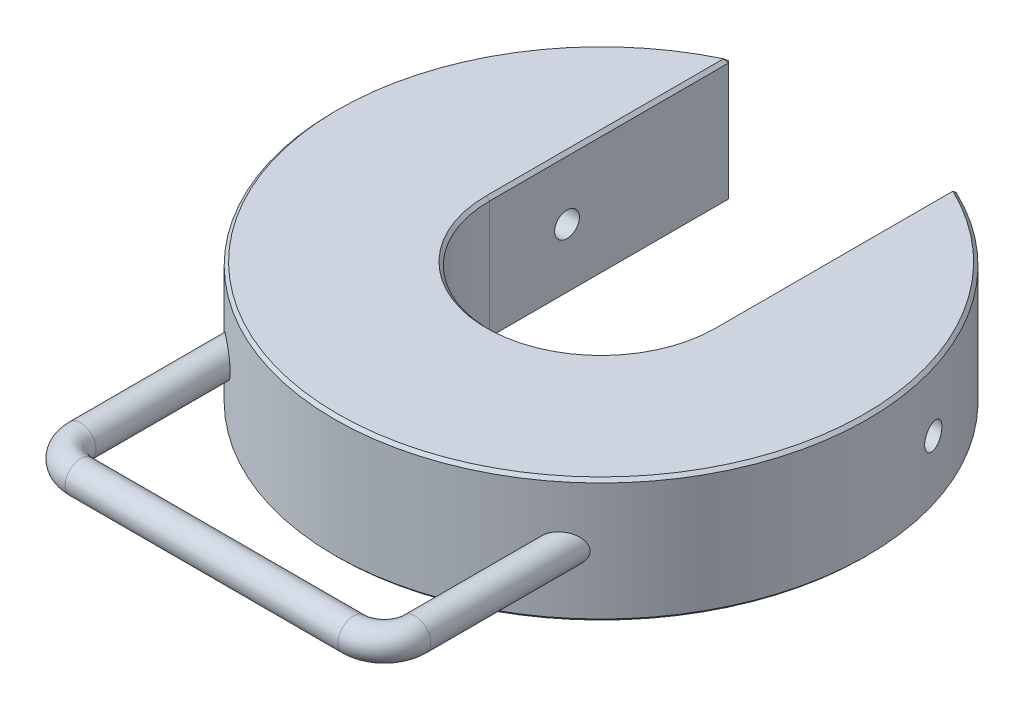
ISO-10303-21;
HEADER;
FILE_DESCRIPTION(('STEP AP214'),'2;1');
FILE_NAME('part.step','',(''),(''),'','','');
FILE_SCHEMA(('AUTOMOTIVE_DESIGN { 1 0 10303 214 1 1 1 1 }'));
ENDSEC;
DATA;
#1=APPLICATION_CONTEXT('core data for automotive mechanical design processes');
#2=APPLICATION_PROTOCOL_DEFINITION('international standard','automotive_design',2000,#1);
#3=PRODUCT_CONTEXT('',#1,'mechanical');
#4=PRODUCT('Part','Part','',(#3));
#5=PRODUCT_RELATED_PRODUCT_CATEGORY('part','',(#4));
#6=PRODUCT_DEFINITION_FORMATION('','',#4);
#7=PRODUCT_DEFINITION_CONTEXT('part definition',#1,'design');
#8=PRODUCT_DEFINITION('design','',#6,#7);
#9=PRODUCT_DEFINITION_SHAPE('','',#8);
#10=(LENGTH_UNIT() NAMED_UNIT(*) SI_UNIT(.MILLI.,.METRE.));
#11=(NAMED_UNIT(*) PLANE_ANGLE_UNIT() SI_UNIT($,.RADIAN.));
#12=(NAMED_UNIT(*) SI_UNIT($,.STERADIAN.) SOLID_ANGLE_UNIT());
#13=UNCERTAINTY_MEASURE_WITH_UNIT(LENGTH_MEASURE(1.E-05),#10,'distance_accuracy_value','');
#14=(GEOMETRIC_REPRESENTATION_CONTEXT(3) GLOBAL_UNCERTAINTY_ASSIGNED_CONTEXT((#13)) GLOBAL_UNIT_ASSIGNED_CONTEXT((#10,
#11,#12)) REPRESENTATION_CONTEXT('',''));
#15=CARTESIAN_POINT('',(0.,0.,0.));
#16=DIRECTION('',(0.,0.,1.));
#17=DIRECTION('',(1.,0.,0.));
#18=AXIS2_PLACEMENT_3D('',#15,#16,#17);
#19=CARTESIAN_POINT('',(0.,40.,0.));
#20=DIRECTION('',(0.,-1.,0.));
#21=DIRECTION('',(0.,0.,-1.));
#22=AXIS2_PLACEMENT_3D('',#19,#20,#21);
#23=CYLINDRICAL_SURFACE('',#22,86.);
#24=CARTESIAN_POINT('',(-59.,20.,62.5699608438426));
#25=CARTESIAN_POINT('',(-58.9999987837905,20.1139886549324,62.5699620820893));
#26=CARTESIAN_POINT('',(-58.9960933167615,20.2280110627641,62.5736453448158));
#27=CARTESIAN_POINT('',(-58.9805467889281,20.4551084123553,62.5882993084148));
#28=CARTESIAN_POINT('',(-58.9689006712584,20.5681826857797,62.5992747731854));
#29=CARTESIAN_POINT('',(-58.9380782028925,20.7926147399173,62.6282954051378));
#30=CARTESIAN_POINT('',(-58.9188866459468,20.903968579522,62.6463548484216));
#31=CARTESIAN_POINT('',(-58.8733355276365,21.1239330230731,62.6891644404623));
#32=CARTESIAN_POINT('',(-58.8469725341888,21.2325422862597,62.7139177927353));
#33=CARTESIAN_POINT('',(-58.7877792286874,21.4454344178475,62.7694085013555));
#34=CARTESIAN_POINT('',(-58.7550011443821,21.5497444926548,62.8000975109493));
#35=CARTESIAN_POINT('',(-58.6833499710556,21.754423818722,62.8670568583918));
#36=CARTESIAN_POINT('',(-58.6444746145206,21.8547915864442,62.9033292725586));
#37=CARTESIAN_POINT('',(-58.5195420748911,22.1492194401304,63.019648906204));
#38=CARTESIAN_POINT('',(-58.4251205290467,22.3368069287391,63.1072530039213));
#39=CARTESIAN_POINT('',(-58.1769139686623,22.7633605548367,63.3362857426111));
#40=CARTESIAN_POINT('',(-58.0144372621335,22.9931966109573,63.4852816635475));
#41=CARTESIAN_POINT('',(-57.751001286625,23.3089093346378,63.724690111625));
#42=CARTESIAN_POINT('',(-57.6597580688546,23.409429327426,63.8072746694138));
#43=CARTESIAN_POINT('',(-57.471519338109,23.6009117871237,63.9768752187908));
#44=CARTESIAN_POINT('',(-57.3745232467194,23.6918732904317,64.0638916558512));
#45=CARTESIAN_POINT('',(-57.0146199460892,24.0038531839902,64.385200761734));
#46=CARTESIAN_POINT('',(-56.7368953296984,24.1975082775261,64.6302577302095));
#47=CARTESIAN_POINT('',(-56.3034786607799,24.440890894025,65.0073500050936));
#48=CARTESIAN_POINT('',(-56.1560962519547,24.5142019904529,65.1347211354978));
#49=CARTESIAN_POINT('',(-55.8565376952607,24.6454251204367,65.3917889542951));
#50=CARTESIAN_POINT('',(-55.7043619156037,24.7033383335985,65.5214854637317));
#51=CARTESIAN_POINT('',(-55.2376079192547,24.8555681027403,65.9164160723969));
#52=CARTESIAN_POINT('',(-54.9169163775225,24.9260948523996,66.1839046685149));
#53=CARTESIAN_POINT('',(-54.2668513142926,25.0035926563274,66.7179571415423));
#54=CARTESIAN_POINT('',(-53.9374730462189,25.0105282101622,66.9845204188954));
#55=CARTESIAN_POINT('',(-53.4258744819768,24.9702828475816,67.3923623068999));
#56=CARTESIAN_POINT('',(-53.2437728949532,24.9459340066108,67.536315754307));
#57=CARTESIAN_POINT('',(-52.8807723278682,24.8766252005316,67.8209186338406));
#58=CARTESIAN_POINT('',(-52.6998735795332,24.8316613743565,67.9615674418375));
#59=CARTESIAN_POINT('',(-52.3413237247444,24.7205889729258,68.2380906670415));
#60=CARTESIAN_POINT('',(-52.1636684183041,24.6545101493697,68.3739715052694));
#61=CARTESIAN_POINT('',(-51.8134043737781,24.5006008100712,68.6397808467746));
#62=CARTESIAN_POINT('',(-51.6407954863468,24.4127709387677,68.7697095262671));
#63=CARTESIAN_POINT('',(-51.2373697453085,24.1763234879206,69.071103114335));
#64=CARTESIAN_POINT('',(-51.0099224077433,24.0173395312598,69.239148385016));
#65=CARTESIAN_POINT('',(-50.5774166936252,23.6558462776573,69.5557093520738));
#66=CARTESIAN_POINT('',(-50.3723261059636,23.4534008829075,69.7042532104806));
#67=CARTESIAN_POINT('',(-50.024335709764,23.042099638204,69.9543006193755));
#68=CARTESIAN_POINT('',(-49.8767404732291,22.8395442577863,70.0595270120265));
#69=CARTESIAN_POINT('',(-49.6769690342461,22.5154670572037,70.2011784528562));
#70=CARTESIAN_POINT('',(-49.6139587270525,22.4040127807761,70.2457139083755));
#71=CARTESIAN_POINT('',(-49.4959457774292,22.1748737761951,70.3289169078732));
#72=CARTESIAN_POINT('',(-49.4409396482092,22.0571917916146,70.3675870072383));
#73=CARTESIAN_POINT('',(-49.3393587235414,21.8154175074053,70.43884982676));
#74=CARTESIAN_POINT('',(-49.2928458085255,21.6912860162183,70.4713979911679));
#75=CARTESIAN_POINT('',(-49.2094907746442,21.438312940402,70.5296292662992));
#76=CARTESIAN_POINT('',(-49.172643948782,21.3094736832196,70.5553157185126));
#77=CARTESIAN_POINT('',(-49.1092386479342,21.048108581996,70.5994629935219));
#78=CARTESIAN_POINT('',(-49.0826774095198,20.9155837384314,70.6179257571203));
#79=CARTESIAN_POINT('',(-49.040320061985,20.6480086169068,70.6473472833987));
#80=CARTESIAN_POINT('',(-49.0245226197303,20.5129586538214,70.6583069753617));
#81=CARTESIAN_POINT('',(-49.0051738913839,20.2572966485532,70.6717273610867));
#82=CARTESIAN_POINT('',(-49.0004195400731,20.1368174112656,70.6750230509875));
#83=CARTESIAN_POINT('',(-48.9996335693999,19.8957737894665,70.6755680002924));
#84=CARTESIAN_POINT('',(-49.0036047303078,19.7752093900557,70.6728153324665));
#85=CARTESIAN_POINT('',(-49.0202109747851,19.5350465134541,70.6612978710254));
#86=CARTESIAN_POINT('',(-49.032840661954,19.4154474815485,70.6525368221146));
#87=CARTESIAN_POINT('',(-49.0665739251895,19.1779934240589,70.6291139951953));
#88=CARTESIAN_POINT('',(-49.0876806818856,19.0601390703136,70.6144500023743));
#89=CARTESIAN_POINT('',(-49.1371422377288,18.8313229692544,70.5800405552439));
#90=CARTESIAN_POINT('',(-49.1652037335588,18.7202667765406,70.5605005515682));
#91=CARTESIAN_POINT('',(-49.2285448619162,18.5012563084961,70.5163233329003));
#92=CARTESIAN_POINT('',(-49.2638269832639,18.3933031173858,70.4916843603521));
#93=CARTESIAN_POINT('',(-49.379869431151,18.0750960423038,70.4104924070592));
#94=CARTESIAN_POINT('',(-49.4708664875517,17.8703104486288,70.346636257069));
#95=CARTESIAN_POINT('',(-49.6832916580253,17.4658572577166,70.1967840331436));
#96=CARTESIAN_POINT('',(-49.8064010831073,17.2675456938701,70.1095532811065));
#97=CARTESIAN_POINT('',(-50.074224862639,16.8950092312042,69.918517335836));
#98=CARTESIAN_POINT('',(-50.2189489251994,16.7207952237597,69.8147046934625));
#99=CARTESIAN_POINT('',(-50.5476872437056,16.3741695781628,69.5771378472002));
#100=CARTESIAN_POINT('',(-50.7343513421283,16.2057621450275,69.4412252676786));
#101=CARTESIAN_POINT('',(-51.1235254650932,15.9028296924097,69.1552138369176));
#102=CARTESIAN_POINT('',(-51.3260449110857,15.7683250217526,69.0051065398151));
#103=CARTESIAN_POINT('',(-51.78146819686,15.5101126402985,68.6642187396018));
#104=CARTESIAN_POINT('',(-52.0366060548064,15.3933769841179,68.4711465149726));
#105=CARTESIAN_POINT('',(-52.5549434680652,15.2054281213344,68.074112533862));
#106=CARTESIAN_POINT('',(-52.8181475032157,15.1342407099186,67.8701446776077));
#107=CARTESIAN_POINT('',(-53.3983278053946,15.0259547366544,67.4149783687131));
#108=CARTESIAN_POINT('',(-53.7158561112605,14.998115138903,67.1622764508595));
#109=CARTESIAN_POINT('',(-54.3473936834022,15.0020848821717,66.6522744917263));
#110=CARTESIAN_POINT('',(-54.6613985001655,15.0339626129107,66.3949695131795));
#111=CARTESIAN_POINT('',(-55.1447658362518,15.1295544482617,65.9932326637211));
#112=CARTESIAN_POINT('',(-55.3178048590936,15.173468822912,65.8482386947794));
#113=CARTESIAN_POINT('',(-55.6594286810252,15.2800092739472,65.5597277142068));
#114=CARTESIAN_POINT('',(-55.8280125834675,15.3426390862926,65.4162110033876));
#115=CARTESIAN_POINT('',(-56.1592957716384,15.486680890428,65.1320282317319));
#116=CARTESIAN_POINT('',(-56.321998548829,15.5680815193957,64.9913605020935));
#117=CARTESIAN_POINT('',(-56.6401228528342,15.7499053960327,64.714302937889));
#118=CARTESIAN_POINT('',(-56.7955471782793,15.8503212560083,64.577911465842));
#119=CARTESIAN_POINT('',(-57.1641872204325,16.1192128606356,64.2521574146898));
#120=CARTESIAN_POINT('',(-57.3726926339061,16.2981819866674,64.065934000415));
#121=CARTESIAN_POINT('',(-57.7646146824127,16.6976160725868,63.7127827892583));
#122=CARTESIAN_POINT('',(-57.9480735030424,16.9180097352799,63.5458226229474));
#123=CARTESIAN_POINT('',(-58.243009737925,17.3452077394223,63.2754482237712));
#124=CARTESIAN_POINT('',(-58.3613502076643,17.5435669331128,63.1662374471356));
#125=CARTESIAN_POINT('',(-58.5726257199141,17.9637641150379,62.9703760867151));
#126=CARTESIAN_POINT('',(-58.6655805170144,18.185583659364,62.8837079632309));
#127=CARTESIAN_POINT('',(-58.8080391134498,18.6125364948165,62.7504789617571));
#128=CARTESIAN_POINT('',(-58.8620735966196,18.8148214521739,62.6997574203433));
#129=CARTESIAN_POINT('',(-58.9239794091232,19.1250278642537,62.6415629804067));
#130=CARTESIAN_POINT('',(-58.9414177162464,19.2294781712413,62.6251518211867));
#131=CARTESIAN_POINT('',(-58.9696771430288,19.4400336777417,62.5985428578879));
#132=CARTESIAN_POINT('',(-58.9805019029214,19.546137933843,62.5883416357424));
#133=CARTESIAN_POINT('',(-58.9919407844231,19.7103775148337,62.5775594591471));
#134=CARTESIAN_POINT('',(-58.9949607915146,19.7682159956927,62.5747122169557));
#135=CARTESIAN_POINT('',(-58.9989908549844,19.8840333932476,62.5709124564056));
#136=CARTESIAN_POINT('',(-59.0000006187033,19.9420123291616,62.5699602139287));
#137=CARTESIAN_POINT('',(-59.,20.,62.5699608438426));
#138=B_SPLINE_CURVE_WITH_KNOTS('',3,(#24,#25,#26,#27,#28,#29,#30,#31,#32,#33,#34,#35,#36,#37,
#38,#39,#40,#41,#42,#43,#44,#45,#46,#47,#48,#49,#50,#51,#52,#53,#54,#55,#56,#57,#58,#59,#60,#61,
#62,#63,#64,#65,#66,#67,#68,#69,#70,#71,#72,#73,#74,#75,#76,#77,#78,#79,#80,#81,#82,#83,#84,#85,
#86,#87,#88,#89,#90,#91,#92,#93,#94,#95,#96,#97,#98,#99,#100,#101,#102,#103,#104,#105,#106,#107,
#108,#109,#110,#111,#112,#113,#114,#115,#116,#117,#118,#119,#120,#121,#122,#123,#124,#125,#126,
#127,#128,#129,#130,#131,#132,#133,#134,#135,#136,#137),.UNSPECIFIED.,.T.,.F.,(4,2,2,2,2,2,2,2,
2,2,2,2,2,2,2,2,2,2,2,2,2,2,2,2,2,2,2,2,2,2,2,2,2,2,2,2,2,2,2,2,2,2,2,2,2,2,2,2,2,2,2,2,2,2,2,2,
4),(0.,0.341899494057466,0.684022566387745,1.02683867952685,1.36981914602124,1.71011545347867,
2.0505386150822,2.73073866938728,3.68071252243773,4.15706138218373,4.63345821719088,
5.87969275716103,6.5036533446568,7.12756611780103,8.39294186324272,9.65902397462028,
10.3584327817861,11.0579726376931,11.7565311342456,12.4550689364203,13.4243529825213,
14.3922215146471,15.20398227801,15.6102271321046,16.0162944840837,16.4252116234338,
16.8339292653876,17.242537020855,17.6510941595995,18.0124925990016,18.3740062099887,
18.7352947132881,19.0967189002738,19.4449251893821,19.7932517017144,20.4893390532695,
21.2340354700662,21.9790673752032,22.8332624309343,23.6879689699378,24.70596528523,
25.7245376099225,26.9401599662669,28.1571753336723,28.8464482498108,29.5358588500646,
30.2248532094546,30.9135804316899,31.9057688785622,32.8962650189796,33.6599439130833,
34.4230268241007,35.0662992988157,35.3874494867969,35.7084227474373,35.8823266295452,
36.0562558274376),.UNSPECIFIED.);
#139=CARTESIAN_POINT('',(-59.,20.,62.5699608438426));
#140=VERTEX_POINT('',#139);
#141=EDGE_CURVE('E12',#140,#140,#138,.T.);
#142=ORIENTED_EDGE('',*,*,#141,.T.);
#143=EDGE_LOOP('',(#142));
#144=FACE_BOUND('',#143,.T.);
#145=ADVANCED_FACE('F49',(#144),#23,.F.);
#146=CARTESIAN_POINT('',(-54.,20.,113.932802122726));
#147=DIRECTION('',(0.,0.,-1.));
#148=DIRECTION('',(-1.,0.,0.));
#149=AXIS2_PLACEMENT_3D('',#146,#147,#148);
#150=CYLINDRICAL_SURFACE('',#149,5.);
#151=ORIENTED_EDGE('',*,*,#141,.F.);
#152=EDGE_LOOP('',(#151));
#153=FACE_BOUND('',#152,.T.);
#154=CARTESIAN_POINT('',(-54.,20.,113.932802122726));
#155=DIRECTION('',(0.,0.,1.));
#156=DIRECTION('',(1.,0.,0.));
#157=AXIS2_PLACEMENT_3D('',#154,#155,#156);
#158=CIRCLE('',#157,5.);
#159=CARTESIAN_POINT('',(-59.,20.,113.932802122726));
#160=VERTEX_POINT('',#159);
#161=EDGE_CURVE('E94',#160,#160,#158,.T.);
#162=ORIENTED_EDGE('',*,*,#161,.F.);
#163=EDGE_LOOP('',(#162));
#164=FACE_BOUND('',#163,.T.);
#165=ADVANCED_FACE('F83',(#153,#164),#150,.T.);
#166=CARTESIAN_POINT('',(59.,20.,62.5699608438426));
#167=CARTESIAN_POINT('',(58.9999987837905,19.8860113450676,62.5699620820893));
#168=CARTESIAN_POINT('',(58.9960933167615,19.7719889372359,62.5736453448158));
#169=CARTESIAN_POINT('',(58.9805467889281,19.5448915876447,62.5882993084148));
#170=CARTESIAN_POINT('',(58.9689006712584,19.4318173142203,62.5992747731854));
#171=CARTESIAN_POINT('',(58.9380782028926,19.2073852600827,62.6282954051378));
#172=CARTESIAN_POINT('',(58.9188866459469,19.096031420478,62.6463548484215));
#173=CARTESIAN_POINT('',(58.8733355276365,18.8760669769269,62.6891644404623));
#174=CARTESIAN_POINT('',(58.8469725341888,18.7674577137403,62.7139177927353));
#175=CARTESIAN_POINT('',(58.7877792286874,18.5545655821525,62.7694085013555));
#176=CARTESIAN_POINT('',(58.7550011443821,18.4502555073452,62.8000975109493));
#177=CARTESIAN_POINT('',(58.6833499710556,18.245576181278,62.8670568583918));
#178=CARTESIAN_POINT('',(58.6444746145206,18.1452084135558,62.9033292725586));
#179=CARTESIAN_POINT('',(58.5195420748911,17.8507805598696,63.019648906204));
#180=CARTESIAN_POINT('',(58.4251205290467,17.6631930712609,63.1072530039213));
#181=CARTESIAN_POINT('',(58.1769139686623,17.2366394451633,63.3362857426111));
#182=CARTESIAN_POINT('',(58.0144372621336,17.0068033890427,63.4852816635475));
#183=CARTESIAN_POINT('',(57.751001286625,16.6910906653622,63.724690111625));
#184=CARTESIAN_POINT('',(57.6597580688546,16.590570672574,63.8072746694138));
#185=CARTESIAN_POINT('',(57.471519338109,16.3990882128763,63.9768752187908));
#186=CARTESIAN_POINT('',(57.3745232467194,16.3081267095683,64.0638916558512));
#187=CARTESIAN_POINT('',(57.0146199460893,15.9961468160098,64.385200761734));
#188=CARTESIAN_POINT('',(56.7368953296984,15.8024917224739,64.6302577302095));
#189=CARTESIAN_POINT('',(56.3034786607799,15.559109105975,65.0073500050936));
#190=CARTESIAN_POINT('',(56.1560962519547,15.4857980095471,65.1347211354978));
#191=CARTESIAN_POINT('',(55.8565376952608,15.3545748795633,65.3917889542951));
#192=CARTESIAN_POINT('',(55.7043619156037,15.2966616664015,65.5214854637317));
#193=CARTESIAN_POINT('',(55.2376079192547,15.1444318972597,65.9164160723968));
#194=CARTESIAN_POINT('',(54.9169163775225,15.0739051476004,66.1839046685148));
#195=CARTESIAN_POINT('',(54.2668513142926,14.9964073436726,66.7179571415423));
#196=CARTESIAN_POINT('',(53.9374730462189,14.9894717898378,66.9845204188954));
#197=CARTESIAN_POINT('',(53.4258744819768,15.0297171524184,67.3923623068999));
#198=CARTESIAN_POINT('',(53.2437728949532,15.0540659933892,67.536315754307));
#199=CARTESIAN_POINT('',(52.8807723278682,15.1233747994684,67.8209186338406));
#200=CARTESIAN_POINT('',(52.6998735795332,15.1683386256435,67.9615674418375));
#201=CARTESIAN_POINT('',(52.3413237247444,15.2794110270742,68.2380906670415));
#202=CARTESIAN_POINT('',(52.1636684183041,15.3454898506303,68.3739715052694));
#203=CARTESIAN_POINT('',(51.8134043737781,15.4993991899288,68.6397808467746));
#204=CARTESIAN_POINT('',(51.6407954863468,15.5872290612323,68.7697095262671));
#205=CARTESIAN_POINT('',(51.2373697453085,15.8236765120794,69.071103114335));
#206=CARTESIAN_POINT('',(51.0099224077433,15.9826604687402,69.239148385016));
#207=CARTESIAN_POINT('',(50.5774166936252,16.3441537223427,69.5557093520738));
#208=CARTESIAN_POINT('',(50.3723261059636,16.5465991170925,69.7042532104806));
#209=CARTESIAN_POINT('',(50.024335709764,16.957900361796,69.9543006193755));
#210=CARTESIAN_POINT('',(49.8767404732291,17.1604557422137,70.0595270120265));
#211=CARTESIAN_POINT('',(49.6769690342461,17.4845329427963,70.2011784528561));
#212=CARTESIAN_POINT('',(49.6139587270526,17.5959872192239,70.2457139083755));
#213=CARTESIAN_POINT('',(49.4959457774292,17.8251262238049,70.3289169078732));
#214=CARTESIAN_POINT('',(49.4409396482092,17.9428082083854,70.3675870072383));
#215=CARTESIAN_POINT('',(49.3393587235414,18.1845824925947,70.43884982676));
#216=CARTESIAN_POINT('',(49.2928458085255,18.3087139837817,70.4713979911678));
#217=CARTESIAN_POINT('',(49.2094907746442,18.561687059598,70.5296292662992));
#218=CARTESIAN_POINT('',(49.172643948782,18.6905263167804,70.5553157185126));
#219=CARTESIAN_POINT('',(49.1092386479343,18.951891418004,70.5994629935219));
#220=CARTESIAN_POINT('',(49.0826774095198,19.0844162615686,70.6179257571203));
#221=CARTESIAN_POINT('',(49.040320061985,19.3519913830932,70.6473472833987));
#222=CARTESIAN_POINT('',(49.0245226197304,19.4870413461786,70.6583069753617));
#223=CARTESIAN_POINT('',(49.005173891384,19.7427033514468,70.6717273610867));
#224=CARTESIAN_POINT('',(49.0004195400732,19.8631825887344,70.6750230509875));
#225=CARTESIAN_POINT('',(48.9996335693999,20.1042262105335,70.6755680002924));
#226=CARTESIAN_POINT('',(49.0036047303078,20.2247906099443,70.6728153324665));
#227=CARTESIAN_POINT('',(49.0202109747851,20.4649534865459,70.6612978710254));
#228=CARTESIAN_POINT('',(49.032840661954,20.5845525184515,70.6525368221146));
#229=CARTESIAN_POINT('',(49.0665739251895,20.8220065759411,70.6291139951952));
#230=CARTESIAN_POINT('',(49.0876806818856,20.9398609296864,70.6144500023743));
#231=CARTESIAN_POINT('',(49.1371422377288,21.1686770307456,70.5800405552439));
#232=CARTESIAN_POINT('',(49.1652037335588,21.2797332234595,70.5605005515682));
#233=CARTESIAN_POINT('',(49.2285448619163,21.4987436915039,70.5163233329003));
#234=CARTESIAN_POINT('',(49.2638269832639,21.6066968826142,70.4916843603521));
#235=CARTESIAN_POINT('',(49.379869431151,21.9249039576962,70.4104924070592));
#236=CARTESIAN_POINT('',(49.4708664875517,22.1296895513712,70.346636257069));
#237=CARTESIAN_POINT('',(49.6832916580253,22.5341427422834,70.1967840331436));
#238=CARTESIAN_POINT('',(49.8064010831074,22.7324543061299,70.1095532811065));
#239=CARTESIAN_POINT('',(50.074224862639,23.1049907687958,69.9185173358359));
#240=CARTESIAN_POINT('',(50.2189489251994,23.2792047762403,69.8147046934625));
#241=CARTESIAN_POINT('',(50.5476872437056,23.6258304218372,69.5771378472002));
#242=CARTESIAN_POINT('',(50.7343513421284,23.7942378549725,69.4412252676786));
#243=CARTESIAN_POINT('',(51.1235254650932,24.0971703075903,69.1552138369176));
#244=CARTESIAN_POINT('',(51.3260449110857,24.2316749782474,69.0051065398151));
#245=CARTESIAN_POINT('',(51.7814681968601,24.4898873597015,68.6642187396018));
#246=CARTESIAN_POINT('',(52.0366060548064,24.6066230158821,68.4711465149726));
#247=CARTESIAN_POINT('',(52.5549434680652,24.7945718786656,68.074112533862));
#248=CARTESIAN_POINT('',(52.8181475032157,24.8657592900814,67.8701446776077));
#249=CARTESIAN_POINT('',(53.3983278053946,24.9740452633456,67.4149783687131));
#250=CARTESIAN_POINT('',(53.7158561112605,25.001884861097,67.1622764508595));
#251=CARTESIAN_POINT('',(54.3473936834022,24.9979151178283,66.6522744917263));
#252=CARTESIAN_POINT('',(54.6613985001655,24.9660373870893,66.3949695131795));
#253=CARTESIAN_POINT('',(55.1447658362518,24.8704455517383,65.9932326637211));
#254=CARTESIAN_POINT('',(55.3178048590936,24.826531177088,65.8482386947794));
#255=CARTESIAN_POINT('',(55.6594286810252,24.7199907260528,65.5597277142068));
#256=CARTESIAN_POINT('',(55.8280125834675,24.6573609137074,65.4162110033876));
#257=CARTESIAN_POINT('',(56.1592957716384,24.513319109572,65.1320282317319));
#258=CARTESIAN_POINT('',(56.3219985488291,24.4319184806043,64.9913605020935));
#259=CARTESIAN_POINT('',(56.6401228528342,24.2500946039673,64.714302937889));
#260=CARTESIAN_POINT('',(56.7955471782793,24.1496787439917,64.577911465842));
#261=CARTESIAN_POINT('',(57.1641872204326,23.8807871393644,64.2521574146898));
#262=CARTESIAN_POINT('',(57.3726926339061,23.7018180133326,64.065934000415));
#263=CARTESIAN_POINT('',(57.7646146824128,23.3023839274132,63.7127827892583));
#264=CARTESIAN_POINT('',(57.9480735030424,23.0819902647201,63.5458226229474));
#265=CARTESIAN_POINT('',(58.243009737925,22.6547922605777,63.2754482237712));
#266=CARTESIAN_POINT('',(58.3613502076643,22.4564330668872,63.1662374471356));
#267=CARTESIAN_POINT('',(58.5726257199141,22.0362358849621,62.9703760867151));
#268=CARTESIAN_POINT('',(58.6655805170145,21.814416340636,62.8837079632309));
#269=CARTESIAN_POINT('',(58.8080391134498,21.3874635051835,62.7504789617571));
#270=CARTESIAN_POINT('',(58.8620735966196,21.185178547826,62.6997574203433));
#271=CARTESIAN_POINT('',(58.9239794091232,20.8749721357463,62.6415629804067));
#272=CARTESIAN_POINT('',(58.9414177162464,20.7705218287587,62.6251518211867));
#273=CARTESIAN_POINT('',(58.9696771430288,20.5599663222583,62.5985428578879));
#274=CARTESIAN_POINT('',(58.9805019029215,20.453862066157,62.5883416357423));
#275=CARTESIAN_POINT('',(58.9919407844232,20.2896224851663,62.5775594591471));
#276=CARTESIAN_POINT('',(58.9949607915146,20.2317840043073,62.5747122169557));
#277=CARTESIAN_POINT('',(58.9989908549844,20.1159666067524,62.5709124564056));
#278=CARTESIAN_POINT('',(59.0000006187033,20.0579876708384,62.5699602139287));
#279=CARTESIAN_POINT('',(59.,20.,62.5699608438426));
#280=B_SPLINE_CURVE_WITH_KNOTS('',3,(#166,#167,#168,#169,#170,#171,#172,#173,#174,#175,#176,
#177,#178,#179,#180,#181,#182,#183,#184,#185,#186,#187,#188,#189,#190,#191,#192,#193,#194,#195,
#196,#197,#198,#199,#200,#201,#202,#203,#204,#205,#206,#207,#208,#209,#210,#211,#212,#213,#214,
#215,#216,#217,#218,#219,#220,#221,#222,#223,#224,#225,#226,#227,#228,#229,#230,#231,#232,#233,
#234,#235,#236,#237,#238,#239,#240,#241,#242,#243,#244,#245,#246,#247,#248,#249,#250,#251,#252,
#253,#254,#255,#256,#257,#258,#259,#260,#261,#262,#263,#264,#265,#266,#267,#268,#269,#270,#271,
#272,#273,#274,#275,#276,#277,#278,#279),.UNSPECIFIED.,.T.,.F.,(4,2,2,2,2,2,2,2,2,2,2,2,2,2,2,2,
2,2,2,2,2,2,2,2,2,2,2,2,2,2,2,2,2,2,2,2,2,2,2,2,2,2,2,2,2,2,2,2,2,2,2,2,2,2,2,2,4),(0.,
0.341899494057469,0.68402256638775,1.02683867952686,1.36981914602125,1.71011545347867,
2.05053861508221,2.73073866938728,3.68071252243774,4.15706138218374,4.63345821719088,
5.87969275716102,6.50365334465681,7.12756611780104,8.39294186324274,9.6590239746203,
10.3584327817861,11.0579726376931,11.7565311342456,12.4550689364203,13.4243529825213,
14.3922215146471,15.20398227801,15.6102271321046,16.0162944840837,16.4252116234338,
16.8339292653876,17.242537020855,17.6510941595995,18.0124925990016,18.3740062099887,
18.7352947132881,19.0967189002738,19.4449251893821,19.7932517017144,20.4893390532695,
21.2340354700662,21.9790673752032,22.8332624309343,23.6879689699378,24.70596528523,
25.7245376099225,26.9401599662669,28.1571753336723,28.8464482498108,29.5358588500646,
30.2248532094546,30.9135804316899,31.9057688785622,32.8962650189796,33.6599439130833,
34.4230268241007,35.0662992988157,35.3874494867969,35.7084227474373,35.8823266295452,
36.0562558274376),.UNSPECIFIED.);
#281=CARTESIAN_POINT('',(59.,20.,62.5699608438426));
#282=VERTEX_POINT('',#281);
#283=EDGE_CURVE('E59',#282,#282,#280,.T.);
#284=ORIENTED_EDGE('',*,*,#283,.T.);
#285=EDGE_LOOP('',(#284));
#286=FACE_BOUND('',#285,.T.);
#287=ADVANCED_FACE('F79',(#286),#23,.F.);
#288=CARTESIAN_POINT('',(54.,20.,66.932802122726));
#289=DIRECTION('',(0.,0.,1.));
#290=DIRECTION('',(1.,0.,0.));
#291=AXIS2_PLACEMENT_3D('',#288,#289,#290);
#292=CYLINDRICAL_SURFACE('',#291,5.);
#293=ORIENTED_EDGE('',*,*,#283,.F.);
#294=EDGE_LOOP('',(#293));
#295=FACE_BOUND('',#294,.T.);
#296=CARTESIAN_POINT('',(54.,20.,113.932802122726));
#297=DIRECTION('',(0.,0.,1.));
#298=DIRECTION('',(1.,0.,0.));
#299=AXIS2_PLACEMENT_3D('',#296,#297,#298);
#300=CIRCLE('',#299,5.);
#301=CARTESIAN_POINT('',(59.,20.,113.932802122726));
#302=VERTEX_POINT('',#301);
#303=EDGE_CURVE('E67',#302,#302,#300,.T.);
#304=ORIENTED_EDGE('',*,*,#303,.F.);
#305=EDGE_LOOP('',(#304));
#306=FACE_BOUND('',#305,.T.);
#307=ADVANCED_FACE('F74',(#295,#306),#292,.T.);
#308=CARTESIAN_POINT('',(-44.,20.,113.932802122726));
#309=DIRECTION('',(0.,1.,0.));
#310=DIRECTION('',(0.,0.,1.));
#311=AXIS2_PLACEMENT_3D('',#308,#309,#310);
#312=TOROIDAL_SURFACE('',#311,9.99999999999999,5.);
#313=CARTESIAN_POINT('',(-43.9999999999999,20.,123.932802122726));
#314=DIRECTION('',(-1.,0.,0.));
#315=DIRECTION('',(0.,0.,1.));
#316=AXIS2_PLACEMENT_3D('',#313,#314,#315);
#317=CIRCLE('',#316,5.);
#318=CARTESIAN_POINT('',(-43.9999999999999,20.,128.932802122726));
#319=VERTEX_POINT('',#318);
#320=EDGE_CURVE('E96',#319,#319,#317,.T.);
#321=CARTESIAN_POINT('',(-44.,20.,113.932802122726));
#322=DIRECTION('',(0.,1.,0.));
#323=DIRECTION('',(0.,0.,1.));
#324=AXIS2_PLACEMENT_3D('',#321,#322,#323);
#325=CIRCLE('',#324,15.);
#326=EDGE_CURVE('',#160,#319,#325,.T.);
#327=ORIENTED_EDGE('',*,*,#161,.T.);
#328=ORIENTED_EDGE('',*,*,#320,.T.);
#329=ORIENTED_EDGE('',*,*,#326,.T.);
#330=ORIENTED_EDGE('',*,*,#326,.F.);
#331=EDGE_LOOP('',(#327,#329,#328,#330));
#332=FACE_BOUND('',#331,.T.);
#333=ADVANCED_FACE('F78',(#332),#312,.T.);
#334=CARTESIAN_POINT('',(43.9999999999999,20.,123.932802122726));
#335=DIRECTION('',(-1.,0.,0.));
#336=DIRECTION('',(0.,0.,1.));
#337=AXIS2_PLACEMENT_3D('',#334,#335,#336);
#338=CYLINDRICAL_SURFACE('',#337,5.);
#339=CARTESIAN_POINT('',(43.9999999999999,20.,123.932802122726));
#340=DIRECTION('',(1.,0.,0.));
#341=DIRECTION('',(0.,0.,-1.));
#342=AXIS2_PLACEMENT_3D('',#339,#340,#341);
#343=CIRCLE('',#342,5.);
#344=CARTESIAN_POINT('',(43.9999999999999,20.,128.932802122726));
#345=VERTEX_POINT('',#344);
#346=EDGE_CURVE('E63',#345,#345,#343,.T.);
#347=ORIENTED_EDGE('',*,*,#346,.F.);
#348=EDGE_LOOP('',(#347));
#349=FACE_BOUND('',#348,.T.);
#350=ORIENTED_EDGE('',*,*,#320,.F.);
#351=EDGE_LOOP('',(#350));
#352=FACE_BOUND('',#351,.T.);
#353=ADVANCED_FACE('F104',(#349,#352),#338,.T.);
#354=CARTESIAN_POINT('',(44.,20.,113.932802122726));
#355=DIRECTION('',(0.,1.,0.));
#356=DIRECTION('',(0.,0.,1.));
#357=AXIS2_PLACEMENT_3D('',#354,#355,#356);
#358=TOROIDAL_SURFACE('',#357,10.,5.);
#359=CARTESIAN_POINT('',(44.,20.,113.932802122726));
#360=DIRECTION('',(0.,1.,0.));
#361=DIRECTION('',(0.,0.,1.));
#362=AXIS2_PLACEMENT_3D('',#359,#360,#361);
#363=CIRCLE('',#362,15.);
#364=EDGE_CURVE('',#345,#302,#363,.T.);
#365=ORIENTED_EDGE('',*,*,#346,.T.);
#366=ORIENTED_EDGE('',*,*,#303,.T.);
#367=ORIENTED_EDGE('',*,*,#364,.T.);
#368=ORIENTED_EDGE('',*,*,#364,.F.);
#369=EDGE_LOOP('',(#365,#367,#366,#368));
#370=FACE_BOUND('',#369,.T.);
#371=ADVANCED_FACE('F81',(#370),#358,.T.);
#372=CLOSED_SHELL('',(#145,#165,#287,#307,#333,#353,#371));
#373=MANIFOLD_SOLID_BREP('B2',#372);
#374=CARTESIAN_POINT('',(0.,40.,0.));
#375=DIRECTION('',(0.,-1.,0.));
#376=DIRECTION('',(0.,0.,-1.));
#377=AXIS2_PLACEMENT_3D('',#374,#375,#376);
#378=CYLINDRICAL_SURFACE('',#377,36.);
#379=DIRECTION('',(0.,-1.,0.));
#380=VECTOR('',#379,1.);
#381=CARTESIAN_POINT('',(36.,40.,0.));
#382=LINE('',#381,#380);
#383=CARTESIAN_POINT('',(36.,39.,0.));
#384=VERTEX_POINT('',#383);
#385=CARTESIAN_POINT('',(36.,1.00000000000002,0.));
#386=VERTEX_POINT('',#385);
#387=EDGE_CURVE('E270',#384,#386,#382,.T.);
#388=ORIENTED_EDGE('',*,*,#387,.T.);
#389=CARTESIAN_POINT('',(0.,1.00000000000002,0.));
#390=DIRECTION('',(0.,1.,0.));
#391=DIRECTION('',(0.,0.,1.));
#392=AXIS2_PLACEMENT_3D('',#389,#390,#391);
#393=CIRCLE('',#392,36.);
#394=CARTESIAN_POINT('',(-36.,1.00000000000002,0.));
#395=VERTEX_POINT('',#394);
#396=EDGE_CURVE('E269',#386,#395,#393,.F.);
#397=ORIENTED_EDGE('',*,*,#396,.T.);
#398=DIRECTION('',(0.,-1.,0.));
#399=VECTOR('',#398,1.);
#400=CARTESIAN_POINT('',(-36.,40.,0.));
#401=LINE('',#400,#399);
#402=CARTESIAN_POINT('',(-36.,39.,0.));
#403=VERTEX_POINT('',#402);
#404=EDGE_CURVE('E253',#403,#395,#401,.T.);
#405=ORIENTED_EDGE('',*,*,#404,.F.);
#406=CARTESIAN_POINT('',(0.,39.,0.));
#407=DIRECTION('',(0.,1.,0.));
#408=DIRECTION('',(0.,0.,1.));
#409=AXIS2_PLACEMENT_3D('',#406,#407,#408);
#410=CIRCLE('',#409,36.);
#411=EDGE_CURVE('E266',#403,#384,#410,.T.);
#412=ORIENTED_EDGE('',*,*,#411,.T.);
#413=EDGE_LOOP('',(#388,#397,#405,#412));
#414=FACE_BOUND('',#413,.T.);
#415=ADVANCED_FACE('F172',(#414),#378,.F.);
#416=CARTESIAN_POINT('',(-36.,40.,0.));
#417=DIRECTION('',(-1.,0.,0.));
#418=DIRECTION('',(0.,0.,1.));
#419=AXIS2_PLACEMENT_3D('',#416,#417,#418);
#420=PLANE('',#419);
#421=CARTESIAN_POINT('',(-36.,20.,-25.));
#422=DIRECTION('',(-1.,0.,0.));
#423=DIRECTION('',(0.,0.,1.));
#424=AXIS2_PLACEMENT_3D('',#421,#422,#423);
#425=CIRCLE('',#424,4.);
#426=CARTESIAN_POINT('',(-36.,20.,-21.));
#427=VERTEX_POINT('',#426);
#428=EDGE_CURVE('E294',#427,#427,#425,.T.);
#429=ORIENTED_EDGE('',*,*,#428,.T.);
#430=EDGE_LOOP('',(#429));
#431=FACE_BOUND('',#430,.T.);
#432=ORIENTED_EDGE('',*,*,#404,.T.);
#433=DIRECTION('',(0.,0.,-1.));
#434=VECTOR('',#433,1.);
#435=CARTESIAN_POINT('',(-36.,1.00000000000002,0.));
#436=LINE('',#435,#434);
#437=CARTESIAN_POINT('',(-36.,1.00000000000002,-77.1024967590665));
#438=VERTEX_POINT('',#437);
#439=EDGE_CURVE('E261',#395,#438,#436,.T.);
#440=ORIENTED_EDGE('',*,*,#439,.T.);
#441=DIRECTION('',(0.,1.,0.));
#442=VECTOR('',#441,1.);
#443=CARTESIAN_POINT('',(-36.,40.,-77.1024967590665));
#444=LINE('',#443,#442);
#445=CARTESIAN_POINT('',(-36.,39.,-77.1024967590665));
#446=VERTEX_POINT('',#445);
#447=EDGE_CURVE('E256',#438,#446,#444,.T.);
#448=ORIENTED_EDGE('',*,*,#447,.T.);
#449=DIRECTION('',(0.,0.,1.));
#450=VECTOR('',#449,1.);
#451=CARTESIAN_POINT('',(-36.,39.,0.));
#452=LINE('',#451,#450);
#453=EDGE_CURVE('E249',#446,#403,#452,.T.);
#454=ORIENTED_EDGE('',*,*,#453,.T.);
#455=EDGE_LOOP('',(#432,#440,#448,#454));
#456=FACE_BOUND('',#455,.T.);
#457=ADVANCED_FACE('F251',(#431,#456),#420,.F.);
#458=CARTESIAN_POINT('',(0.,40.,0.));
#459=DIRECTION('',(0.,-1.,0.));
#460=DIRECTION('',(0.,0.,-1.));
#461=AXIS2_PLACEMENT_3D('',#458,#459,#460);
#462=CYLINDRICAL_SURFACE('',#461,86.);
#463=CARTESIAN_POINT('',(-80.9629544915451,20.,-29.));
#464=CARTESIAN_POINT('',(-80.9629541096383,20.1077203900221,-29.0000008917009));
#465=CARTESIAN_POINT('',(-80.9645144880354,20.2154283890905,-28.9956458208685));
#466=CARTESIAN_POINT('',(-80.9707357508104,20.4300884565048,-28.9782683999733));
#467=CARTESIAN_POINT('',(-80.9753974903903,20.5370403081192,-28.9652436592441));
#468=CARTESIAN_POINT('',(-80.9877688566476,20.7494676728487,-28.9306348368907));
#469=CARTESIAN_POINT('',(-80.9954812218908,20.8549417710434,-28.9090430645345));
#470=CARTESIAN_POINT('',(-81.0138597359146,21.0636035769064,-28.8574995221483));
#471=CARTESIAN_POINT('',(-81.0245270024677,21.1667904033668,-28.8275445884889));
#472=CARTESIAN_POINT('',(-81.0486587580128,21.3699024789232,-28.7596280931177));
#473=CARTESIAN_POINT('',(-81.0621169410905,21.469834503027,-28.7216845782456));
#474=CARTESIAN_POINT('',(-81.0916856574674,21.6660299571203,-28.6380949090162));
#475=CARTESIAN_POINT('',(-81.1077971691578,21.7622920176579,-28.5924459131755));
#476=CARTESIAN_POINT('',(-81.1598339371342,22.0445286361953,-28.4445476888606));
#477=CARTESIAN_POINT('',(-81.1994903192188,22.2241932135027,-28.3312664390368));
#478=CARTESIAN_POINT('',(-81.288235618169,22.5665900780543,-28.075638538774));
#479=CARTESIAN_POINT('',(-81.3375497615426,22.7287361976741,-27.9325914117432));
#480=CARTESIAN_POINT('',(-81.4429914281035,23.0269771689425,-27.6236450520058));
#481=CARTESIAN_POINT('',(-81.4991207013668,23.163065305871,-27.457739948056));
#482=CARTESIAN_POINT('',(-81.6194496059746,23.4130344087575,-27.098030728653));
#483=CARTESIAN_POINT('',(-81.6839219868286,23.5253077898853,-26.9032007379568));
#484=CARTESIAN_POINT('',(-81.816123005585,23.7154681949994,-26.4984405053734));
#485=CARTESIAN_POINT('',(-81.8838524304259,23.7933468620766,-26.288506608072));
#486=CARTESIAN_POINT('',(-82.023409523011,23.9155741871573,-25.8498627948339));
#487=CARTESIAN_POINT('',(-82.0952893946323,23.9583660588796,-25.6207343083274));
#488=CARTESIAN_POINT('',(-82.238197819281,24.0036178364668,-25.1582473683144));
#489=CARTESIAN_POINT('',(-82.3092262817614,24.0060734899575,-24.9248884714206));
#490=CARTESIAN_POINT('',(-82.449265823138,23.9700659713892,-24.4576923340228));
#491=CARTESIAN_POINT('',(-82.5182434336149,23.931122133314,-24.2238816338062));
#492=CARTESIAN_POINT('',(-82.6514172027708,23.8121017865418,-23.7655255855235));
#493=CARTESIAN_POINT('',(-82.7156137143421,23.7320283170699,-23.54097955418));
#494=CARTESIAN_POINT('',(-82.8363799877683,23.5343409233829,-23.1123954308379));
#495=CARTESIAN_POINT('',(-82.8930725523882,23.4174775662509,-22.9080462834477));
#496=CARTESIAN_POINT('',(-82.9988660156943,23.1485767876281,-22.5217315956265));
#497=CARTESIAN_POINT('',(-83.0479684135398,22.9965463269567,-22.3397616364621));
#498=CARTESIAN_POINT('',(-83.1358383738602,22.6673837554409,-22.0104626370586));
#499=CARTESIAN_POINT('',(-83.1749107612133,22.4913334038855,-21.8621337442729));
#500=CARTESIAN_POINT('',(-83.2440872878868,22.1152050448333,-21.5972391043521));
#501=CARTESIAN_POINT('',(-83.2741932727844,21.9151319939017,-21.4806668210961));
#502=CARTESIAN_POINT('',(-83.3239489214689,21.5040785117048,-21.2868328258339));
#503=CARTESIAN_POINT('',(-83.3439220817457,21.2937083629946,-21.2083589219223));
#504=CARTESIAN_POINT('',(-83.3745570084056,20.8621808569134,-21.087606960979));
#505=CARTESIAN_POINT('',(-83.3852201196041,20.641025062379,-21.045323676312));
#506=CARTESIAN_POINT('',(-83.3969104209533,20.1994746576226,-20.9989498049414));
#507=CARTESIAN_POINT('',(-83.39814606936,19.9791719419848,-20.9940329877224));
#508=CARTESIAN_POINT('',(-83.3915101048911,19.5408884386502,-21.020376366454));
#509=CARTESIAN_POINT('',(-83.3836390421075,19.3229075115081,-21.0516343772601));
#510=CARTESIAN_POINT('',(-83.359002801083,18.8967834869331,-21.1489745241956));
#511=CARTESIAN_POINT('',(-83.342291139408,18.6885893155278,-21.2148471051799));
#512=CARTESIAN_POINT('',(-83.3003019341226,18.2863981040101,-21.3791216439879));
#513=CARTESIAN_POINT('',(-83.2750241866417,18.0924014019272,-21.4775243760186));
#514=CARTESIAN_POINT('',(-83.2160497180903,17.7218188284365,-21.7049061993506));
#515=CARTESIAN_POINT('',(-83.182267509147,17.5454368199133,-21.834195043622));
#516=CARTESIAN_POINT('',(-83.1070605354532,17.2169252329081,-22.1187272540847));
#517=CARTESIAN_POINT('',(-83.0656349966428,17.0647981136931,-22.2739732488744));
#518=CARTESIAN_POINT('',(-82.9748191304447,16.7849249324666,-22.6099616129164));
#519=CARTESIAN_POINT('',(-82.925255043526,16.6578863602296,-22.7912459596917));
#520=CARTESIAN_POINT('',(-82.8199829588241,16.4359214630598,-23.170869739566));
#521=CARTESIAN_POINT('',(-82.7642739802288,16.3410002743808,-23.3692118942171));
#522=CARTESIAN_POINT('',(-82.6458980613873,16.1824463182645,-23.784526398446));
#523=CARTESIAN_POINT('',(-82.5830570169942,16.1200103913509,-24.0019059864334));
#524=CARTESIAN_POINT('',(-82.4535864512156,16.0325951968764,-24.4429731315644));
#525=CARTESIAN_POINT('',(-82.3869562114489,16.0076230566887,-24.6666618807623));
#526=CARTESIAN_POINT('',(-82.2492767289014,15.9951654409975,-25.122000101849));
#527=CARTESIAN_POINT('',(-82.1781542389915,16.0089726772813,-25.3536636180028));
#528=CARTESIAN_POINT('',(-82.0356442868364,16.0762669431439,-25.8110544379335));
#529=CARTESIAN_POINT('',(-81.9642567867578,16.1297598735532,-26.0367808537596));
#530=CARTESIAN_POINT('',(-81.8221420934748,16.2764486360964,-26.4800312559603));
#531=CARTESIAN_POINT('',(-81.751446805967,16.3703045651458,-26.6973503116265));
#532=CARTESIAN_POINT('',(-81.6487960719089,16.5390842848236,-27.0090022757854));
#533=CARTESIAN_POINT('',(-81.6151269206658,16.6000514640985,-27.1105504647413));
#534=CARTESIAN_POINT('',(-81.5492239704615,16.7309819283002,-27.3081466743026));
#535=CARTESIAN_POINT('',(-81.5169895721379,16.8009414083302,-27.4041969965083));
#536=CARTESIAN_POINT('',(-81.4547350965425,16.9483672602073,-27.5886839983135));
#537=CARTESIAN_POINT('',(-81.4246897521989,17.0257105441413,-27.6772106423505));
#538=CARTESIAN_POINT('',(-81.3666363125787,17.1882285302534,-27.8474159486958));
#539=CARTESIAN_POINT('',(-81.3386273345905,17.2733998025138,-27.9290975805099));
#540=CARTESIAN_POINT('',(-81.2849366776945,17.4510983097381,-28.0849759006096));
#541=CARTESIAN_POINT('',(-81.2592561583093,17.5436291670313,-28.1591688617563));
#542=CARTESIAN_POINT('',(-81.2105597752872,17.7353374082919,-28.2993018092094));
#543=CARTESIAN_POINT('',(-81.1875426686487,17.8345116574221,-28.365245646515));
#544=CARTESIAN_POINT('',(-81.1454468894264,18.0341290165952,-28.4854404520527));
#545=CARTESIAN_POINT('',(-81.1262358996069,18.1343047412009,-28.5400893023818));
#546=CARTESIAN_POINT('',(-81.0907446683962,18.339338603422,-28.6407747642));
#547=CARTESIAN_POINT('',(-81.0744630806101,18.4441945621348,-28.686815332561));
#548=CARTESIAN_POINT('',(-81.0450528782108,18.657719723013,-28.7697991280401));
#549=CARTESIAN_POINT('',(-81.0319202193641,18.7663838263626,-28.8067540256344));
#550=CARTESIAN_POINT('',(-81.0089646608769,18.9867687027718,-28.8712454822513));
#551=CARTESIAN_POINT('',(-80.999140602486,19.0984883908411,-28.898785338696));
#552=CARTESIAN_POINT('',(-80.9817377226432,19.3408143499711,-28.9475202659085));
#553=CARTESIAN_POINT('',(-80.9747049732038,19.4717725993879,-28.9671770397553));
#554=CARTESIAN_POINT('',(-80.9653136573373,19.7351601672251,-28.9934161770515));
#555=CARTESIAN_POINT('',(-80.9629549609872,19.8675894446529,-28.9999989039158));
#556=CARTESIAN_POINT('',(-80.9629544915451,20.,-29.));
#557=B_SPLINE_CURVE_WITH_KNOTS('',3,(#463,#464,#465,#466,#467,#468,#469,#470,#471,#472,#473,
#474,#475,#476,#477,#478,#479,#480,#481,#482,#483,#484,#485,#486,#487,#488,#489,#490,#491,#492,
#493,#494,#495,#496,#497,#498,#499,#500,#501,#502,#503,#504,#505,#506,#507,#508,#509,#510,#511,
#512,#513,#514,#515,#516,#517,#518,#519,#520,#521,#522,#523,#524,#525,#526,#527,#528,#529,#530,
#531,#532,#533,#534,#535,#536,#537,#538,#539,#540,#541,#542,#543,#544,#545,#546,#547,#548,#549,
#550,#551,#552,#553,#554,#555,#556),.UNSPECIFIED.,.T.,.F.,(4,2,2,2,2,2,2,2,2,2,2,2,2,2,2,2,2,2,
2,2,2,2,2,2,2,2,2,2,2,2,2,2,2,2,2,2,2,2,2,2,2,2,2,2,2,2,4),(0.,0.323040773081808,
0.646170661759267,0.969591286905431,1.29313442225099,1.61595434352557,1.93889356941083,
2.58401782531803,3.24651246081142,3.90917758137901,4.60783403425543,5.30666014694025,
6.03503126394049,6.76347916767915,7.50047799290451,8.23742236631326,8.96021247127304,
9.68285963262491,10.3798718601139,11.0767405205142,11.7496846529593,12.4225315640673,
13.0804562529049,13.738341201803,14.3922884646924,15.0462512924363,15.7070704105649,
16.3679564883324,17.0454242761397,17.7230003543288,18.424031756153,19.1251965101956,
19.8500093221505,20.5749299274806,21.312185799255,21.6812204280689,22.0500994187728,
22.4136478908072,22.777037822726,23.1406077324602,23.5040072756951,23.8507196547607,
24.1972722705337,24.5433773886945,24.8893611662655,25.2864558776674,25.6835395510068),.UNSPECIFIED.);
#558=CARTESIAN_POINT('',(-80.9629544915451,20.,-29.));
#559=VERTEX_POINT('',#558);
#560=EDGE_CURVE('E504',#559,#559,#557,.T.);
#561=ORIENTED_EDGE('',*,*,#560,.T.);
#562=EDGE_LOOP('',(#561));
#563=FACE_BOUND('',#562,.T.);
#564=CARTESIAN_POINT('',(80.9629544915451,20.,-29.));
#565=CARTESIAN_POINT('',(80.9629541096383,19.8922796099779,-29.0000008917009));
#566=CARTESIAN_POINT('',(80.9645144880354,19.7845716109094,-28.9956458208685));
#567=CARTESIAN_POINT('',(80.9707357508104,19.5699115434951,-28.9782683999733));
#568=CARTESIAN_POINT('',(80.9753974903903,19.4629596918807,-28.9652436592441));
#569=CARTESIAN_POINT('',(80.9877688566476,19.2505323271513,-28.9306348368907));
#570=CARTESIAN_POINT('',(80.9954812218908,19.1450582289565,-28.9090430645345));
#571=CARTESIAN_POINT('',(81.0138597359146,18.9363964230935,-28.8574995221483));
#572=CARTESIAN_POINT('',(81.0245270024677,18.8332095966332,-28.8275445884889));
#573=CARTESIAN_POINT('',(81.0486587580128,18.6300975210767,-28.7596280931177));
#574=CARTESIAN_POINT('',(81.0621169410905,18.5301654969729,-28.7216845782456));
#575=CARTESIAN_POINT('',(81.0916856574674,18.3339700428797,-28.6380949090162));
#576=CARTESIAN_POINT('',(81.1077971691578,18.2377079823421,-28.5924459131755));
#577=CARTESIAN_POINT('',(81.1598339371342,17.9554713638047,-28.4445476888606));
#578=CARTESIAN_POINT('',(81.1994903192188,17.7758067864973,-28.3312664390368));
#579=CARTESIAN_POINT('',(81.288235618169,17.4334099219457,-28.075638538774));
#580=CARTESIAN_POINT('',(81.3375497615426,17.2712638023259,-27.9325914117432));
#581=CARTESIAN_POINT('',(81.4429914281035,16.9730228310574,-27.6236450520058));
#582=CARTESIAN_POINT('',(81.4991207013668,16.836934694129,-27.457739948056));
#583=CARTESIAN_POINT('',(81.6194496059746,16.5869655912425,-27.098030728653));
#584=CARTESIAN_POINT('',(81.6839219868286,16.4746922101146,-26.9032007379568));
#585=CARTESIAN_POINT('',(81.816123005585,16.2845318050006,-26.4984405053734));
#586=CARTESIAN_POINT('',(81.8838524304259,16.2066531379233,-26.288506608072));
#587=CARTESIAN_POINT('',(82.023409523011,16.0844258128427,-25.8498627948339));
#588=CARTESIAN_POINT('',(82.0952893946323,16.0416339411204,-25.6207343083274));
#589=CARTESIAN_POINT('',(82.238197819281,15.9963821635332,-25.1582473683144));
#590=CARTESIAN_POINT('',(82.3092262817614,15.9939265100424,-24.9248884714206));
#591=CARTESIAN_POINT('',(82.449265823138,16.0299340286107,-24.4576923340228));
#592=CARTESIAN_POINT('',(82.5182434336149,16.0688778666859,-24.2238816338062));
#593=CARTESIAN_POINT('',(82.6514172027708,16.1878982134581,-23.7655255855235));
#594=CARTESIAN_POINT('',(82.7156137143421,16.2679716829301,-23.54097955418));
#595=CARTESIAN_POINT('',(82.8363799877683,16.4656590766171,-23.1123954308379));
#596=CARTESIAN_POINT('',(82.8930725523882,16.582522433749,-22.9080462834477));
#597=CARTESIAN_POINT('',(82.9988660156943,16.8514232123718,-22.5217315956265));
#598=CARTESIAN_POINT('',(83.0479684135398,17.0034536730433,-22.3397616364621));
#599=CARTESIAN_POINT('',(83.1358383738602,17.3326162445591,-22.0104626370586));
#600=CARTESIAN_POINT('',(83.1749107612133,17.5086665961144,-21.8621337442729));
#601=CARTESIAN_POINT('',(83.2440872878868,17.8847949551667,-21.5972391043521));
#602=CARTESIAN_POINT('',(83.2741932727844,18.0848680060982,-21.4806668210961));
#603=CARTESIAN_POINT('',(83.3239489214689,18.4959214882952,-21.2868328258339));
#604=CARTESIAN_POINT('',(83.3439220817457,18.7062916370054,-21.2083589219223));
#605=CARTESIAN_POINT('',(83.3745570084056,19.1378191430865,-21.087606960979));
#606=CARTESIAN_POINT('',(83.3852201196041,19.3589749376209,-21.045323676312));
#607=CARTESIAN_POINT('',(83.3969104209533,19.8005253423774,-20.9989498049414));
#608=CARTESIAN_POINT('',(83.39814606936,20.0208280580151,-20.9940329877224));
#609=CARTESIAN_POINT('',(83.3915101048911,20.4591115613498,-21.020376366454));
#610=CARTESIAN_POINT('',(83.3836390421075,20.6770924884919,-21.0516343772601));
#611=CARTESIAN_POINT('',(83.359002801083,21.1032165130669,-21.1489745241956));
#612=CARTESIAN_POINT('',(83.342291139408,21.3114106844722,-21.2148471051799));
#613=CARTESIAN_POINT('',(83.3003019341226,21.7136018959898,-21.3791216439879));
#614=CARTESIAN_POINT('',(83.2750241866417,21.9075985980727,-21.4775243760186));
#615=CARTESIAN_POINT('',(83.2160497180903,22.2781811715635,-21.7049061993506));
#616=CARTESIAN_POINT('',(83.182267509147,22.4545631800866,-21.834195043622));
#617=CARTESIAN_POINT('',(83.1070605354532,22.7830747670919,-22.1187272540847));
#618=CARTESIAN_POINT('',(83.0656349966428,22.9352018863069,-22.2739732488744));
#619=CARTESIAN_POINT('',(82.9748191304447,23.2150750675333,-22.6099616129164));
#620=CARTESIAN_POINT('',(82.925255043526,23.3421136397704,-22.7912459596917));
#621=CARTESIAN_POINT('',(82.8199829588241,23.5640785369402,-23.170869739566));
#622=CARTESIAN_POINT('',(82.7642739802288,23.6589997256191,-23.3692118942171));
#623=CARTESIAN_POINT('',(82.6458980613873,23.8175536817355,-23.784526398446));
#624=CARTESIAN_POINT('',(82.5830570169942,23.8799896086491,-24.0019059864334));
#625=CARTESIAN_POINT('',(82.4535864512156,23.9674048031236,-24.4429731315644));
#626=CARTESIAN_POINT('',(82.3869562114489,23.9923769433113,-24.6666618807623));
#627=CARTESIAN_POINT('',(82.2492767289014,24.0048345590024,-25.122000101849));
#628=CARTESIAN_POINT('',(82.1781542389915,23.9910273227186,-25.3536636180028));
#629=CARTESIAN_POINT('',(82.0356442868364,23.923733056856,-25.8110544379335));
#630=CARTESIAN_POINT('',(81.9642567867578,23.8702401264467,-26.0367808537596));
#631=CARTESIAN_POINT('',(81.8221420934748,23.7235513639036,-26.4800312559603));
#632=CARTESIAN_POINT('',(81.751446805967,23.6296954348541,-26.6973503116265));
#633=CARTESIAN_POINT('',(81.6487960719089,23.4609157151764,-27.0090022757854));
#634=CARTESIAN_POINT('',(81.6151269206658,23.3999485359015,-27.1105504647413));
#635=CARTESIAN_POINT('',(81.5492239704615,23.2690180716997,-27.3081466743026));
#636=CARTESIAN_POINT('',(81.5169895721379,23.1990585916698,-27.4041969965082));
#637=CARTESIAN_POINT('',(81.4547350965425,23.0516327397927,-27.5886839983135));
#638=CARTESIAN_POINT('',(81.4246897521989,22.9742894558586,-27.6772106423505));
#639=CARTESIAN_POINT('',(81.3666363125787,22.8117714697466,-27.8474159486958));
#640=CARTESIAN_POINT('',(81.3386273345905,22.7266001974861,-27.9290975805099));
#641=CARTESIAN_POINT('',(81.2849366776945,22.5489016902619,-28.0849759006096));
#642=CARTESIAN_POINT('',(81.2592561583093,22.4563708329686,-28.1591688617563));
#643=CARTESIAN_POINT('',(81.2105597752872,22.264662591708,-28.2993018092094));
#644=CARTESIAN_POINT('',(81.1875426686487,22.1654883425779,-28.365245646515));
#645=CARTESIAN_POINT('',(81.1454468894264,21.9658709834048,-28.4854404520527));
#646=CARTESIAN_POINT('',(81.1262358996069,21.8656952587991,-28.5400893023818));
#647=CARTESIAN_POINT('',(81.0907446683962,21.660661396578,-28.6407747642));
#648=CARTESIAN_POINT('',(81.0744630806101,21.5558054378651,-28.686815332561));
#649=CARTESIAN_POINT('',(81.0450528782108,21.3422802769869,-28.7697991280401));
#650=CARTESIAN_POINT('',(81.0319202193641,21.2336161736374,-28.8067540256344));
#651=CARTESIAN_POINT('',(81.0089646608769,21.0132312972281,-28.8712454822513));
#652=CARTESIAN_POINT('',(80.999140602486,20.9015116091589,-28.898785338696));
#653=CARTESIAN_POINT('',(80.9817377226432,20.6591856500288,-28.9475202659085));
#654=CARTESIAN_POINT('',(80.9747049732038,20.528227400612,-28.9671770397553));
#655=CARTESIAN_POINT('',(80.9653136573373,20.2648398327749,-28.9934161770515));
#656=CARTESIAN_POINT('',(80.9629549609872,20.1324105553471,-28.9999989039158));
#657=CARTESIAN_POINT('',(80.9629544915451,20.,-29.));
#658=B_SPLINE_CURVE_WITH_KNOTS('',3,(#564,#565,#566,#567,#568,#569,#570,#571,#572,#573,#574,
#575,#576,#577,#578,#579,#580,#581,#582,#583,#584,#585,#586,#587,#588,#589,#590,#591,#592,#593,
#594,#595,#596,#597,#598,#599,#600,#601,#602,#603,#604,#605,#606,#607,#608,#609,#610,#611,#612,
#613,#614,#615,#616,#617,#618,#619,#620,#621,#622,#623,#624,#625,#626,#627,#628,#629,#630,#631,
#632,#633,#634,#635,#636,#637,#638,#639,#640,#641,#642,#643,#644,#645,#646,#647,#648,#649,#650,
#651,#652,#653,#654,#655,#656,#657),.UNSPECIFIED.,.T.,.F.,(4,2,2,2,2,2,2,2,2,2,2,2,2,2,2,2,2,2,
2,2,2,2,2,2,2,2,2,2,2,2,2,2,2,2,2,2,2,2,2,2,2,2,2,2,2,2,4),(0.,0.323040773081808,
0.646170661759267,0.969591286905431,1.29313442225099,1.61595434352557,1.93889356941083,
2.58401782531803,3.24651246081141,3.90917758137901,4.60783403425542,5.30666014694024,
6.03503126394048,6.76347916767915,7.50047799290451,8.23742236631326,8.96021247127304,
9.68285963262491,10.3798718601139,11.0767405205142,11.7496846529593,12.4225315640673,
13.0804562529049,13.738341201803,14.3922884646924,15.0462512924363,15.7070704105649,
16.3679564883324,17.0454242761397,17.7230003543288,18.424031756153,19.1251965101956,
19.8500093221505,20.5749299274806,21.312185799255,21.6812204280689,22.0500994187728,
22.4136478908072,22.777037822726,23.1406077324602,23.5040072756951,23.8507196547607,
24.1972722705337,24.5433773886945,24.8893611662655,25.2864558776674,25.6835395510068),.UNSPECIFIED.);
#659=CARTESIAN_POINT('',(80.9629544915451,20.,-29.));
#660=VERTEX_POINT('',#659);
#661=EDGE_CURVE('E500',#660,#660,#658,.T.);
#662=ORIENTED_EDGE('',*,*,#661,.T.);
#663=EDGE_LOOP('',(#662));
#664=FACE_BOUND('',#663,.T.);
#665=CARTESIAN_POINT('',(0.,1.00000000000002,0.));
#666=DIRECTION('',(0.,1.,0.));
#667=DIRECTION('',(0.,0.,1.));
#668=AXIS2_PLACEMENT_3D('',#665,#666,#667);
#669=CIRCLE('',#668,86.);
#670=CARTESIAN_POINT('',(-36.6820128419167,1.00000000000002,-77.7845096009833));
#671=VERTEX_POINT('',#670);
#672=CARTESIAN_POINT('',(36.9005429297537,1.00000000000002,-77.6810783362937));
#673=VERTEX_POINT('',#672);
#674=EDGE_CURVE('E312',#671,#673,#669,.T.);
#675=ORIENTED_EDGE('',*,*,#674,.T.);
#676=DIRECTION('',(0.,-1.,0.));
#677=VECTOR('',#676,1.);
#678=CARTESIAN_POINT('',(36.9005429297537,40.,-77.6810783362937));
#679=LINE('',#678,#677);
#680=CARTESIAN_POINT('',(36.9005429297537,39.,-77.6810783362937));
#681=VERTEX_POINT('',#680);
#682=EDGE_CURVE('E315',#673,#681,#679,.F.);
#683=ORIENTED_EDGE('',*,*,#682,.T.);
#684=CARTESIAN_POINT('',(0.,39.,0.));
#685=DIRECTION('',(0.,1.,0.));
#686=DIRECTION('',(0.,0.,1.));
#687=AXIS2_PLACEMENT_3D('',#684,#685,#686);
#688=CIRCLE('',#687,86.);
#689=CARTESIAN_POINT('',(-36.6820128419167,39.,-77.7845096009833));
#690=VERTEX_POINT('',#689);
#691=EDGE_CURVE('E310',#681,#690,#688,.F.);
#692=ORIENTED_EDGE('',*,*,#691,.T.);
#693=DIRECTION('',(0.,-1.,0.));
#694=VECTOR('',#693,1.);
#695=CARTESIAN_POINT('',(-36.6820128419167,40.,-77.7845096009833));
#696=LINE('',#695,#694);
#697=EDGE_CURVE('E308',#690,#671,#696,.T.);
#698=ORIENTED_EDGE('',*,*,#697,.T.);
#699=EDGE_LOOP('',(#675,#683,#692,#698));
#700=FACE_BOUND('',#699,.T.);
#701=ADVANCED_FACE('F372',(#563,#664,#700),#462,.T.);
#702=CARTESIAN_POINT('',(36.,40.,0.));
#703=DIRECTION('',(1.,0.,0.));
#704=DIRECTION('',(0.,0.,-1.));
#705=AXIS2_PLACEMENT_3D('',#702,#703,#704);
#706=PLANE('',#705);
#707=CARTESIAN_POINT('',(36.,20.,-25.));
#708=DIRECTION('',(1.,0.,0.));
#709=DIRECTION('',(0.,0.,-1.));
#710=AXIS2_PLACEMENT_3D('',#707,#708,#709);
#711=CIRCLE('',#710,4.);
#712=CARTESIAN_POINT('',(36.,20.,-29.));
#713=VERTEX_POINT('',#712);
#714=EDGE_CURVE('E177',#713,#713,#711,.T.);
#715=ORIENTED_EDGE('',*,*,#714,.T.);
#716=EDGE_LOOP('',(#715));
#717=FACE_BOUND('',#716,.T.);
#718=DIRECTION('',(0.,-1.,0.));
#719=VECTOR('',#718,1.);
#720=CARTESIAN_POINT('',(36.,40.,-77.3487884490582));
#721=LINE('',#720,#719);
#722=CARTESIAN_POINT('',(36.,39.,-77.3487884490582));
#723=VERTEX_POINT('',#722);
#724=CARTESIAN_POINT('',(36.,1.00000000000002,-77.3487884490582));
#725=VERTEX_POINT('',#724);
#726=EDGE_CURVE('E317',#723,#725,#721,.T.);
#727=ORIENTED_EDGE('',*,*,#726,.T.);
#728=DIRECTION('',(0.,0.,1.));
#729=VECTOR('',#728,1.);
#730=CARTESIAN_POINT('',(36.,1.00000000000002,0.));
#731=LINE('',#730,#729);
#732=EDGE_CURVE('E279',#725,#386,#731,.T.);
#733=ORIENTED_EDGE('',*,*,#732,.T.);
#734=ORIENTED_EDGE('',*,*,#387,.F.);
#735=DIRECTION('',(0.,0.,-1.));
#736=VECTOR('',#735,1.);
#737=CARTESIAN_POINT('',(36.,39.,-78.1024967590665));
#738=LINE('',#737,#736);
#739=EDGE_CURVE('E319',#384,#723,#738,.T.);
#740=ORIENTED_EDGE('',*,*,#739,.T.);
#741=EDGE_LOOP('',(#727,#733,#734,#740));
#742=FACE_BOUND('',#741,.T.);
#743=ADVANCED_FACE('F485',(#717,#742),#706,.F.);
#744=CARTESIAN_POINT('',(0.,40.,0.));
#745=DIRECTION('',(0.,1.,0.));
#746=DIRECTION('',(0.,0.,1.));
#747=AXIS2_PLACEMENT_3D('',#744,#745,#746);
#748=PLANE('',#747);
#749=CARTESIAN_POINT('',(0.,40.,0.));
#750=DIRECTION('',(0.,1.,0.));
#751=DIRECTION('',(0.,0.,1.));
#752=AXIS2_PLACEMENT_3D('',#749,#750,#751);
#753=CIRCLE('',#752,85.);
#754=CARTESIAN_POINT('',(-37.,40.,-76.5245058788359));
#755=VERTEX_POINT('',#754);
#756=CARTESIAN_POINT('',(37.,40.,-76.5245058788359));
#757=VERTEX_POINT('',#756);
#758=EDGE_CURVE('E182',#755,#757,#753,.T.);
#759=ORIENTED_EDGE('',*,*,#758,.T.);
#760=DIRECTION('',(0.,0.,1.));
#761=VECTOR('',#760,1.);
#762=CARTESIAN_POINT('',(37.,40.,0.));
#763=LINE('',#762,#761);
#764=CARTESIAN_POINT('',(37.,40.,0.));
#765=VERTEX_POINT('',#764);
#766=EDGE_CURVE('E47',#757,#765,#763,.T.);
#767=ORIENTED_EDGE('',*,*,#766,.T.);
#768=CARTESIAN_POINT('',(0.,40.,0.));
#769=DIRECTION('',(0.,1.,0.));
#770=DIRECTION('',(0.,0.,1.));
#771=AXIS2_PLACEMENT_3D('',#768,#769,#770);
#772=CIRCLE('',#771,37.);
#773=CARTESIAN_POINT('',(-37.,40.,0.));
#774=VERTEX_POINT('',#773);
#775=EDGE_CURVE('E323',#765,#774,#772,.F.);
#776=ORIENTED_EDGE('',*,*,#775,.T.);
#777=DIRECTION('',(0.,0.,-1.));
#778=VECTOR('',#777,1.);
#779=CARTESIAN_POINT('',(-37.,40.,-78.1024967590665));
#780=LINE('',#779,#778);
#781=EDGE_CURVE('E193',#774,#755,#780,.T.);
#782=ORIENTED_EDGE('',*,*,#781,.T.);
#783=EDGE_LOOP('',(#759,#767,#776,#782));
#784=FACE_BOUND('',#783,.T.);
#785=ADVANCED_FACE('F481',(#784),#748,.T.);
#786=CARTESIAN_POINT('',(0.,0.,0.));
#787=DIRECTION('',(0.,1.,0.));
#788=DIRECTION('',(0.,0.,1.));
#789=AXIS2_PLACEMENT_3D('',#786,#787,#788);
#790=PLANE('',#789);
#791=CARTESIAN_POINT('',(0.,0.,0.));
#792=DIRECTION('',(0.,1.,0.));
#793=DIRECTION('',(0.,0.,1.));
#794=AXIS2_PLACEMENT_3D('',#791,#792,#793);
#795=CIRCLE('',#794,85.);
#796=CARTESIAN_POINT('',(37.,0.,-76.5245058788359));
#797=VERTEX_POINT('',#796);
#798=CARTESIAN_POINT('',(-37.,0.,-76.5245058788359));
#799=VERTEX_POINT('',#798);
#800=EDGE_CURVE('E303',#797,#799,#795,.F.);
#801=ORIENTED_EDGE('',*,*,#800,.T.);
#802=DIRECTION('',(0.,0.,1.));
#803=VECTOR('',#802,1.);
#804=CARTESIAN_POINT('',(-37.,0.,0.));
#805=LINE('',#804,#803);
#806=CARTESIAN_POINT('',(-37.,0.,0.));
#807=VERTEX_POINT('',#806);
#808=EDGE_CURVE('E305',#799,#807,#805,.T.);
#809=ORIENTED_EDGE('',*,*,#808,.T.);
#810=CARTESIAN_POINT('',(0.,0.,0.));
#811=DIRECTION('',(0.,1.,0.));
#812=DIRECTION('',(0.,0.,1.));
#813=AXIS2_PLACEMENT_3D('',#810,#811,#812);
#814=CIRCLE('',#813,37.);
#815=CARTESIAN_POINT('',(37.,0.,0.));
#816=VERTEX_POINT('',#815);
#817=EDGE_CURVE('E299',#807,#816,#814,.T.);
#818=ORIENTED_EDGE('',*,*,#817,.T.);
#819=DIRECTION('',(0.,0.,-1.));
#820=VECTOR('',#819,1.);
#821=CARTESIAN_POINT('',(37.,0.,0.));
#822=LINE('',#821,#820);
#823=EDGE_CURVE('E301',#816,#797,#822,.T.);
#824=ORIENTED_EDGE('',*,*,#823,.T.);
#825=EDGE_LOOP('',(#801,#809,#818,#824));
#826=FACE_BOUND('',#825,.T.);
#827=ADVANCED_FACE('F392',(#826),#790,.F.);
#828=CARTESIAN_POINT('',(37.,40.,0.));
#829=DIRECTION('',(-0.707106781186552,0.707106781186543,0.));
#830=DIRECTION('',(0.,0.,-1.));
#831=AXIS2_PLACEMENT_3D('',#828,#829,#830);
#832=PLANE('',#831);
#833=DIRECTION('',(0.610910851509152,0.61091085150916,0.503563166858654));
#834=VECTOR('',#833,1.);
#835=CARTESIAN_POINT('',(36.,39.,-77.3487884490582));
#836=LINE('',#835,#834);
#837=EDGE_CURVE('E282',#723,#757,#836,.T.);
#838=ORIENTED_EDGE('',*,*,#837,.F.);
#839=ORIENTED_EDGE('',*,*,#739,.F.);
#840=DIRECTION('',(-0.707106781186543,-0.707106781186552,0.));
#841=VECTOR('',#840,1.);
#842=CARTESIAN_POINT('',(37.,40.,0.));
#843=LINE('',#842,#841);
#844=EDGE_CURVE('E278',#765,#384,#843,.T.);
#845=ORIENTED_EDGE('',*,*,#844,.F.);
#846=ORIENTED_EDGE('',*,*,#766,.F.);
#847=EDGE_LOOP('',(#838,#839,#845,#846));
#848=FACE_BOUND('',#847,.T.);
#849=ADVANCED_FACE('F175',(#848),#832,.T.);
#850=CARTESIAN_POINT('',(0.,40.,0.));
#851=DIRECTION('',(0.,1.,0.));
#852=DIRECTION('',(0.,0.,1.));
#853=AXIS2_PLACEMENT_3D('',#850,#851,#852);
#854=CONICAL_SURFACE('',#853,37.,0.785398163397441);
#855=ORIENTED_EDGE('',*,*,#844,.T.);
#856=ORIENTED_EDGE('',*,*,#411,.F.);
#857=DIRECTION('',(0.707106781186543,-0.707106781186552,0.));
#858=VECTOR('',#857,1.);
#859=CARTESIAN_POINT('',(-37.,40.,0.));
#860=LINE('',#859,#858);
#861=EDGE_CURVE('E276',#774,#403,#860,.T.);
#862=ORIENTED_EDGE('',*,*,#861,.F.);
#863=ORIENTED_EDGE('',*,*,#775,.F.);
#864=EDGE_LOOP('',(#855,#856,#862,#863));
#865=FACE_BOUND('',#864,.T.);
#866=ADVANCED_FACE('F275',(#865),#854,.F.);
#867=CARTESIAN_POINT('',(36.,39.,-77.3487884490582));
#868=DIRECTION('',(-0.230615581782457,0.745787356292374,-0.624994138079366));
#869=DIRECTION('',(0.,0.642307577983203,0.766446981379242));
#870=AXIS2_PLACEMENT_3D('',#867,#868,#869);
#871=PLANE('',#870);
#872=DIRECTION('',(0.938170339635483,0.,-0.346173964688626));
#873=VECTOR('',#872,1.);
#874=CARTESIAN_POINT('',(36.,39.,-77.3487884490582));
#875=LINE('',#874,#873);
#876=EDGE_CURVE('E288',#723,#681,#875,.T.);
#877=ORIENTED_EDGE('',*,*,#876,.F.);
#878=ORIENTED_EDGE('',*,*,#837,.T.);
#879=CARTESIAN_POINT('',(-49.4425383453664,-34.8921446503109,-133.994834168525));
#880=DIRECTION('',(-0.230615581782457,0.745787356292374,-0.624994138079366));
#881=DIRECTION('',(-0.258172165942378,-0.666184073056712,-0.699675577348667));
#882=AXIS2_PLACEMENT_3D('',#879,#880,#881);
#883=ELLIPSE('',#882,214.393745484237,71.8771016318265);
#884=EDGE_CURVE('E283',#681,#757,#883,.F.);
#885=ORIENTED_EDGE('',*,*,#884,.F.);
#886=EDGE_LOOP('',(#877,#878,#885));
#887=FACE_BOUND('',#886,.T.);
#888=ADVANCED_FACE('F365',(#887),#871,.T.);
#889=CARTESIAN_POINT('',(-37.,40.,0.));
#890=DIRECTION('',(0.707106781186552,0.707106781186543,0.));
#891=DIRECTION('',(0.,0.,1.));
#892=AXIS2_PLACEMENT_3D('',#889,#890,#891);
#893=PLANE('',#892);
#894=ORIENTED_EDGE('',*,*,#861,.T.);
#895=ORIENTED_EDGE('',*,*,#453,.F.);
#896=DIRECTION('',(0.654549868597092,-0.654549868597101,-0.37832385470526));
#897=VECTOR('',#896,1.);
#898=CARTESIAN_POINT('',(-36.1233104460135,39.1233104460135,-77.0312244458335));
#899=LINE('',#898,#897);
#900=EDGE_CURVE('E354',#755,#446,#899,.T.);
#901=ORIENTED_EDGE('',*,*,#900,.F.);
#902=ORIENTED_EDGE('',*,*,#781,.F.);
#903=EDGE_LOOP('',(#894,#895,#901,#902));
#904=FACE_BOUND('',#903,.T.);
#905=ADVANCED_FACE('F281',(#904),#893,.T.);
#906=CARTESIAN_POINT('',(0.,40.,0.));
#907=DIRECTION('',(0.,-1.,0.));
#908=DIRECTION('',(0.,0.,-1.));
#909=AXIS2_PLACEMENT_3D('',#906,#907,#908);
#910=CONICAL_SURFACE('',#909,85.,0.785398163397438);
#911=ORIENTED_EDGE('',*,*,#884,.T.);
#912=ORIENTED_EDGE('',*,*,#758,.F.);
#913=CARTESIAN_POINT('',(193.049100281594,-179.629719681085,-193.049100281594));
#914=DIRECTION('',(0.471926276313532,0.744695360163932,-0.471926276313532));
#915=DIRECTION('',(0.526579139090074,-0.66740454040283,-0.526579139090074));
#916=AXIS2_PLACEMENT_3D('',#913,#914,#915);
#917=ELLIPSE('',#916,409.066224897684,135.141984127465);
#918=EDGE_CURVE('E351',#690,#755,#917,.T.);
#919=ORIENTED_EDGE('',*,*,#918,.F.);
#920=ORIENTED_EDGE('',*,*,#691,.F.);
#921=EDGE_LOOP('',(#911,#912,#919,#920));
#922=FACE_BOUND('',#921,.T.);
#923=ADVANCED_FACE('F369',(#922),#910,.T.);
#924=CARTESIAN_POINT('',(36.,40.,-77.3487884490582));
#925=DIRECTION('',(0.346173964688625,0.,0.938170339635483));
#926=DIRECTION('',(0.,-1.,0.));
#927=AXIS2_PLACEMENT_3D('',#924,#925,#926);
#928=PLANE('',#927);
#929=ORIENTED_EDGE('',*,*,#876,.T.);
#930=ORIENTED_EDGE('',*,*,#682,.F.);
#931=DIRECTION('',(-0.938170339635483,0.,0.346173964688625));
#932=VECTOR('',#931,1.);
#933=CARTESIAN_POINT('',(36.9005429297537,1.00000000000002,-77.6810783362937));
#934=LINE('',#933,#932);
#935=EDGE_CURVE('E348',#725,#673,#934,.F.);
#936=ORIENTED_EDGE('',*,*,#935,.F.);
#937=ORIENTED_EDGE('',*,*,#726,.F.);
#938=EDGE_LOOP('',(#929,#930,#936,#937));
#939=FACE_BOUND('',#938,.T.);
#940=ADVANCED_FACE('F361',(#939),#928,.F.);
#941=CARTESIAN_POINT('',(-36.6820128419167,39.,-77.7845096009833));
#942=DIRECTION('',(0.471926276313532,0.744695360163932,-0.471926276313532));
#943=DIRECTION('',(0.,0.535283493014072,0.844672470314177));
#944=AXIS2_PLACEMENT_3D('',#941,#942,#943);
#945=PLANE('',#944);
#946=ORIENTED_EDGE('',*,*,#918,.T.);
#947=ORIENTED_EDGE('',*,*,#900,.T.);
#948=DIRECTION('',(0.707106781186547,0.,0.707106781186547));
#949=VECTOR('',#948,1.);
#950=CARTESIAN_POINT('',(-36.6820128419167,39.,-77.7845096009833));
#951=LINE('',#950,#949);
#952=EDGE_CURVE('E342',#690,#446,#951,.T.);
#953=ORIENTED_EDGE('',*,*,#952,.F.);
#954=EDGE_LOOP('',(#946,#947,#953));
#955=FACE_BOUND('',#954,.T.);
#956=ADVANCED_FACE('F401',(#955),#945,.T.);
#957=CARTESIAN_POINT('',(36.9005429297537,1.00000000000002,-77.6810783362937));
#958=DIRECTION('',(-0.230615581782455,-0.74578735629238,-0.624994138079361));
#959=DIRECTION('',(0.,0.642307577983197,-0.766446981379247));
#960=AXIS2_PLACEMENT_3D('',#957,#958,#959);
#961=PLANE('',#960);
#962=CARTESIAN_POINT('',(-49.4425383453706,74.8921446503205,-133.994834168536));
#963=DIRECTION('',(-0.230615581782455,-0.74578735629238,-0.624994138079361));
#964=DIRECTION('',(-0.25817216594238,0.666184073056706,-0.699675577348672));
#965=AXIS2_PLACEMENT_3D('',#962,#963,#964);
#966=ELLIPSE('',#965,214.393745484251,71.8771016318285);
#967=EDGE_CURVE('E340',#797,#673,#966,.F.);
#968=ORIENTED_EDGE('',*,*,#967,.F.);
#969=DIRECTION('',(0.61091085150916,-0.610910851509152,0.503563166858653));
#970=VECTOR('',#969,1.);
#971=CARTESIAN_POINT('',(36.233870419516,0.766129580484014,-77.1560131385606));
#972=LINE('',#971,#970);
#973=EDGE_CURVE('E345',#725,#797,#972,.T.);
#974=ORIENTED_EDGE('',*,*,#973,.F.);
#975=ORIENTED_EDGE('',*,*,#935,.T.);
#976=EDGE_LOOP('',(#968,#974,#975));
#977=FACE_BOUND('',#976,.T.);
#978=ADVANCED_FACE('F399',(#977),#961,.T.);
#979=CARTESIAN_POINT('',(36.,1.00000000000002,0.));
#980=DIRECTION('',(0.707106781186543,0.707106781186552,0.));
#981=DIRECTION('',(0.,0.,1.));
#982=AXIS2_PLACEMENT_3D('',#979,#980,#981);
#983=PLANE('',#982);
#984=ORIENTED_EDGE('',*,*,#973,.T.);
#985=ORIENTED_EDGE('',*,*,#823,.F.);
#986=DIRECTION('',(0.707106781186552,-0.707106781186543,0.));
#987=VECTOR('',#986,1.);
#988=CARTESIAN_POINT('',(36.,1.00000000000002,0.));
#989=LINE('',#988,#987);
#990=EDGE_CURVE('E337',#386,#816,#989,.T.);
#991=ORIENTED_EDGE('',*,*,#990,.F.);
#992=ORIENTED_EDGE('',*,*,#732,.F.);
#993=EDGE_LOOP('',(#984,#985,#991,#992));
#994=FACE_BOUND('',#993,.T.);
#995=ADVANCED_FACE('F397',(#994),#983,.F.);
#996=CARTESIAN_POINT('',(-36.6820128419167,40.,-77.7845096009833));
#997=DIRECTION('',(-0.707106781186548,0.,0.707106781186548));
#998=DIRECTION('',(0.,-1.,0.));
#999=AXIS2_PLACEMENT_3D('',#996,#997,#998);
#1000=PLANE('',#999);
#1001=ORIENTED_EDGE('',*,*,#952,.T.);
#1002=ORIENTED_EDGE('',*,*,#447,.F.);
#1003=DIRECTION('',(-0.707106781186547,0.,-0.707106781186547));
#1004=VECTOR('',#1003,1.);
#1005=CARTESIAN_POINT('',(-36.,1.00000000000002,-77.1024967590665));
#1006=LINE('',#1005,#1004);
#1007=EDGE_CURVE('E334',#671,#438,#1006,.F.);
#1008=ORIENTED_EDGE('',*,*,#1007,.F.);
#1009=ORIENTED_EDGE('',*,*,#697,.F.);
#1010=EDGE_LOOP('',(#1001,#1002,#1008,#1009));
#1011=FACE_BOUND('',#1010,.T.);
#1012=ADVANCED_FACE('F383',(#1011),#1000,.F.);
#1013=CARTESIAN_POINT('',(0.,1.00000000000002,0.));
#1014=DIRECTION('',(0.,1.,0.));
#1015=DIRECTION('',(0.,0.,1.));
#1016=AXIS2_PLACEMENT_3D('',#1013,#1014,#1015);
#1017=CONICAL_SURFACE('',#1016,86.,0.785398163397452);
#1018=ORIENTED_EDGE('',*,*,#967,.T.);
#1019=ORIENTED_EDGE('',*,*,#674,.F.);
#1020=CARTESIAN_POINT('',(193.049100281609,219.6297196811,-193.049100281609));
#1021=DIRECTION('',(0.471926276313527,-0.744695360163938,-0.471926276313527));
#1022=DIRECTION('',(0.526579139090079,0.667404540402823,-0.526579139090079));
#1023=AXIS2_PLACEMENT_3D('',#1020,#1021,#1022);
#1024=ELLIPSE('',#1023,409.066224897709,135.141984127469);
#1025=EDGE_CURVE('E331',#799,#671,#1024,.T.);
#1026=ORIENTED_EDGE('',*,*,#1025,.F.);
#1027=ORIENTED_EDGE('',*,*,#800,.F.);
#1028=EDGE_LOOP('',(#1018,#1019,#1026,#1027));
#1029=FACE_BOUND('',#1028,.T.);
#1030=ADVANCED_FACE('F378',(#1029),#1017,.T.);
#1031=CARTESIAN_POINT('',(0.,1.00000000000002,0.));
#1032=DIRECTION('',(0.,-1.,0.));
#1033=DIRECTION('',(0.,0.,-1.));
#1034=AXIS2_PLACEMENT_3D('',#1031,#1032,#1033);
#1035=CONICAL_SURFACE('',#1034,36.,0.785398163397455);
#1036=ORIENTED_EDGE('',*,*,#990,.T.);
#1037=ORIENTED_EDGE('',*,*,#817,.F.);
#1038=DIRECTION('',(-0.707106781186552,-0.707106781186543,0.));
#1039=VECTOR('',#1038,1.);
#1040=CARTESIAN_POINT('',(-36.,1.00000000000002,0.));
#1041=LINE('',#1040,#1039);
#1042=EDGE_CURVE('E329',#395,#807,#1041,.T.);
#1043=ORIENTED_EDGE('',*,*,#1042,.F.);
#1044=ORIENTED_EDGE('',*,*,#396,.F.);
#1045=EDGE_LOOP('',(#1036,#1037,#1043,#1044));
#1046=FACE_BOUND('',#1045,.T.);
#1047=ADVANCED_FACE('F431',(#1046),#1035,.F.);
#1048=CARTESIAN_POINT('',(-36.,1.00000000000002,-77.1024967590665));
#1049=DIRECTION('',(0.471926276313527,-0.744695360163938,-0.471926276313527));
#1050=DIRECTION('',(0.,0.535283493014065,-0.844672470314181));
#1051=AXIS2_PLACEMENT_3D('',#1048,#1049,#1050);
#1052=PLANE('',#1051);
#1053=ORIENTED_EDGE('',*,*,#1025,.T.);
#1054=ORIENTED_EDGE('',*,*,#1007,.T.);
#1055=DIRECTION('',(0.654549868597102,0.654549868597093,-0.378323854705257));
#1056=VECTOR('',#1055,1.);
#1057=CARTESIAN_POINT('',(-36.,1.00000000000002,-77.1024967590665));
#1058=LINE('',#1057,#1056);
#1059=EDGE_CURVE('E327',#799,#438,#1058,.T.);
#1060=ORIENTED_EDGE('',*,*,#1059,.F.);
#1061=EDGE_LOOP('',(#1053,#1054,#1060));
#1062=FACE_BOUND('',#1061,.T.);
#1063=ADVANCED_FACE('F386',(#1062),#1052,.T.);
#1064=CARTESIAN_POINT('',(-36.,1.00000000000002,0.));
#1065=DIRECTION('',(-0.707106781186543,0.707106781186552,0.));
#1066=DIRECTION('',(0.,0.,-1.));
#1067=AXIS2_PLACEMENT_3D('',#1064,#1065,#1066);
#1068=PLANE('',#1067);
#1069=ORIENTED_EDGE('',*,*,#1042,.T.);
#1070=ORIENTED_EDGE('',*,*,#808,.F.);
#1071=ORIENTED_EDGE('',*,*,#1059,.T.);
#1072=ORIENTED_EDGE('',*,*,#439,.F.);
#1073=EDGE_LOOP('',(#1069,#1070,#1071,#1072));
#1074=FACE_BOUND('',#1073,.T.);
#1075=ADVANCED_FACE('F389',(#1074),#1068,.F.);
#1076=CARTESIAN_POINT('',(-86.,20.,-25.));
#1077=DIRECTION('',(1.,0.,0.));
#1078=DIRECTION('',(0.,0.,-1.));
#1079=AXIS2_PLACEMENT_3D('',#1076,#1077,#1078);
#1080=CYLINDRICAL_SURFACE('',#1079,4.);
#1081=ORIENTED_EDGE('',*,*,#714,.F.);
#1082=EDGE_LOOP('',(#1081));
#1083=FACE_BOUND('',#1082,.T.);
#1084=ORIENTED_EDGE('',*,*,#661,.F.);
#1085=EDGE_LOOP('',(#1084));
#1086=FACE_BOUND('',#1085,.T.);
#1087=ADVANCED_FACE('F426',(#1083,#1086),#1080,.F.);
#1088=ORIENTED_EDGE('',*,*,#560,.F.);
#1089=EDGE_LOOP('',(#1088));
#1090=FACE_BOUND('',#1089,.T.);
#1091=ORIENTED_EDGE('',*,*,#428,.F.);
#1092=EDGE_LOOP('',(#1091));
#1093=FACE_BOUND('',#1092,.T.);
#1094=ADVANCED_FACE('F493',(#1090,#1093),#1080,.F.);
#1095=CLOSED_SHELL('',(#415,#457,#701,#743,#785,#827,#849,#866,#888,#905,#923,#940,#956,#978,
#995,#1012,#1030,#1047,#1063,#1075,#1087,#1094));
#1096=MANIFOLD_SOLID_BREP('B7',#1095);
#1097=ADVANCED_BREP_SHAPE_REPRESENTATION('',(#18,#373,#1096),#14);
#1098=SHAPE_DEFINITION_REPRESENTATION(#9,#1097);
ENDSEC;
END-ISO-10303-21;
